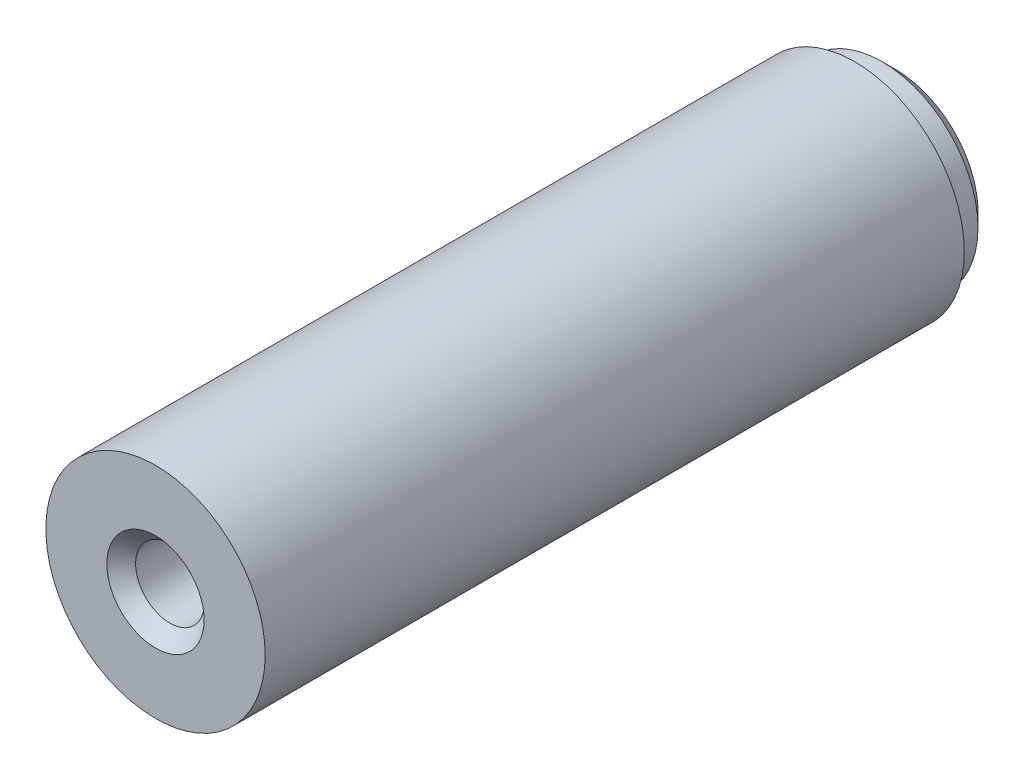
ISO-10303-21;
HEADER;
FILE_DESCRIPTION(('STEP AP214'),'2;1');
FILE_NAME('part.step','',(''),(''),'','','');
FILE_SCHEMA(('AUTOMOTIVE_DESIGN { 1 0 10303 214 1 1 1 1 }'));
ENDSEC;
DATA;
#1=APPLICATION_CONTEXT('core data for automotive mechanical design processes');
#2=APPLICATION_PROTOCOL_DEFINITION('international standard','automotive_design',2000,#1);
#3=PRODUCT_CONTEXT('',#1,'mechanical');
#4=PRODUCT('Part','Part','',(#3));
#5=PRODUCT_RELATED_PRODUCT_CATEGORY('part','',(#4));
#6=PRODUCT_DEFINITION_FORMATION('','',#4);
#7=PRODUCT_DEFINITION_CONTEXT('part definition',#1,'design');
#8=PRODUCT_DEFINITION('design','',#6,#7);
#9=PRODUCT_DEFINITION_SHAPE('','',#8);
#10=(LENGTH_UNIT() NAMED_UNIT(*) SI_UNIT(.MILLI.,.METRE.));
#11=(NAMED_UNIT(*) PLANE_ANGLE_UNIT() SI_UNIT($,.RADIAN.));
#12=(NAMED_UNIT(*) SI_UNIT($,.STERADIAN.) SOLID_ANGLE_UNIT());
#13=UNCERTAINTY_MEASURE_WITH_UNIT(LENGTH_MEASURE(1.E-05),#10,'distance_accuracy_value','');
#14=(GEOMETRIC_REPRESENTATION_CONTEXT(3) GLOBAL_UNCERTAINTY_ASSIGNED_CONTEXT((#13)) GLOBAL_UNIT_ASSIGNED_CONTEXT((#10,
#11,#12)) REPRESENTATION_CONTEXT('',''));
#15=CARTESIAN_POINT('',(0.,0.,0.));
#16=DIRECTION('',(0.,0.,1.));
#17=DIRECTION('',(1.,0.,0.));
#18=AXIS2_PLACEMENT_3D('',#15,#16,#17);
#19=CARTESIAN_POINT('',(0.,0.,0.));
#20=DIRECTION('',(0.,0.,1.));
#21=DIRECTION('',(1.,0.,0.));
#22=AXIS2_PLACEMENT_3D('',#19,#20,#21);
#23=PLANE('',#22);
#24=CARTESIAN_POINT('',(0.,0.,0.));
#25=DIRECTION('',(0.,0.,1.));
#26=DIRECTION('',(1.,0.,0.));
#27=AXIS2_PLACEMENT_3D('',#24,#25,#26);
#28=CIRCLE('',#27,4.);
#29=CARTESIAN_POINT('',(4.,0.,0.));
#30=VERTEX_POINT('',#29);
#31=EDGE_CURVE('E73',#30,#30,#28,.T.);
#32=ORIENTED_EDGE('',*,*,#31,.F.);
#33=EDGE_LOOP('',(#32));
#34=FACE_BOUND('',#33,.T.);
#35=CARTESIAN_POINT('',(0.,0.,0.));
#36=DIRECTION('',(0.,0.,1.));
#37=DIRECTION('',(1.,0.,0.));
#38=AXIS2_PLACEMENT_3D('',#35,#36,#37);
#39=CIRCLE('',#38,3.5);
#40=CARTESIAN_POINT('',(3.5,0.,0.));
#41=VERTEX_POINT('',#40);
#42=EDGE_CURVE('E85',#41,#41,#39,.F.);
#43=ORIENTED_EDGE('',*,*,#42,.F.);
#44=EDGE_LOOP('',(#43));
#45=FACE_BOUND('',#44,.T.);
#46=ADVANCED_FACE('F53',(#34,#45),#23,.F.);
#47=CARTESIAN_POINT('',(0.,0.,25.5));
#48=DIRECTION('',(0.,0.,-1.));
#49=DIRECTION('',(-1.,0.,0.));
#50=AXIS2_PLACEMENT_3D('',#47,#48,#49);
#51=CYLINDRICAL_SURFACE('',#50,4.);
#52=CARTESIAN_POINT('',(0.,0.,25.5));
#53=DIRECTION('',(0.,0.,1.));
#54=DIRECTION('',(1.,0.,0.));
#55=AXIS2_PLACEMENT_3D('',#52,#53,#54);
#56=CIRCLE('',#55,4.);
#57=CARTESIAN_POINT('',(4.,0.,25.5));
#58=VERTEX_POINT('',#57);
#59=EDGE_CURVE('E77',#58,#58,#56,.T.);
#60=ORIENTED_EDGE('',*,*,#59,.F.);
#61=EDGE_LOOP('',(#60));
#62=FACE_BOUND('',#61,.T.);
#63=ORIENTED_EDGE('',*,*,#31,.T.);
#64=EDGE_LOOP('',(#63));
#65=FACE_BOUND('',#64,.T.);
#66=ADVANCED_FACE('F102',(#62,#65),#51,.T.);
#67=CARTESIAN_POINT('',(0.,0.,25.5));
#68=DIRECTION('',(0.,0.,1.));
#69=DIRECTION('',(1.,0.,0.));
#70=AXIS2_PLACEMENT_3D('',#67,#68,#69);
#71=PLANE('',#70);
#72=CARTESIAN_POINT('',(0.,0.,25.5));
#73=DIRECTION('',(0.,0.,1.));
#74=DIRECTION('',(1.,0.,0.));
#75=AXIS2_PLACEMENT_3D('',#72,#73,#74);
#76=CIRCLE('',#75,1.775);
#77=CARTESIAN_POINT('',(1.775,0.,25.5));
#78=VERTEX_POINT('',#77);
#79=EDGE_CURVE('E80',#78,#78,#76,.T.);
#80=ORIENTED_EDGE('',*,*,#79,.F.);
#81=EDGE_LOOP('',(#80));
#82=FACE_BOUND('',#81,.T.);
#83=ORIENTED_EDGE('',*,*,#59,.T.);
#84=EDGE_LOOP('',(#83));
#85=FACE_BOUND('',#84,.T.);
#86=ADVANCED_FACE('F67',(#82,#85),#71,.T.);
#87=CARTESIAN_POINT('',(0.,0.,10.5));
#88=DIRECTION('',(0.,0.,1.));
#89=DIRECTION('',(1.,0.,0.));
#90=AXIS2_PLACEMENT_3D('',#87,#88,#89);
#91=CONICAL_SURFACE('',#90,1.25,1.02974425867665);
#92=CARTESIAN_POINT('',(0.,0.,9.74892422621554));
#93=VERTEX_POINT('',#92);
#94=VERTEX_LOOP('',#93);
#95=FACE_BOUND('',#94,.T.);
#96=CARTESIAN_POINT('',(0.,0.,10.5));
#97=DIRECTION('',(0.,0.,1.));
#98=DIRECTION('',(1.,0.,0.));
#99=AXIS2_PLACEMENT_3D('',#96,#97,#98);
#100=CIRCLE('',#99,1.25);
#101=CARTESIAN_POINT('',(1.25,0.,10.5));
#102=VERTEX_POINT('',#101);
#103=EDGE_CURVE('E71',#102,#102,#100,.T.);
#104=ORIENTED_EDGE('',*,*,#103,.T.);
#105=EDGE_LOOP('',(#104));
#106=FACE_BOUND('',#105,.T.);
#107=ADVANCED_FACE('F63',(#95,#106),#91,.F.);
#108=CARTESIAN_POINT('',(0.,0.,25.5));
#109=DIRECTION('',(0.,0.,1.));
#110=DIRECTION('',(1.,0.,0.));
#111=AXIS2_PLACEMENT_3D('',#108,#109,#110);
#112=CYLINDRICAL_SURFACE('',#111,1.25);
#113=ORIENTED_EDGE('',*,*,#103,.F.);
#114=EDGE_LOOP('',(#113));
#115=FACE_BOUND('',#114,.T.);
#116=CARTESIAN_POINT('',(0.,0.,24.975));
#117=DIRECTION('',(0.,0.,1.));
#118=DIRECTION('',(1.,0.,0.));
#119=AXIS2_PLACEMENT_3D('',#116,#117,#118);
#120=CIRCLE('',#119,1.25);
#121=CARTESIAN_POINT('',(1.25,0.,24.975));
#122=VERTEX_POINT('',#121);
#123=EDGE_CURVE('E74',#122,#122,#120,.T.);
#124=ORIENTED_EDGE('',*,*,#123,.T.);
#125=EDGE_LOOP('',(#124));
#126=FACE_BOUND('',#125,.T.);
#127=ADVANCED_FACE('F66',(#115,#126),#112,.F.);
#128=CARTESIAN_POINT('',(0.,0.,25.5));
#129=DIRECTION('',(0.,0.,1.));
#130=DIRECTION('',(1.,0.,0.));
#131=AXIS2_PLACEMENT_3D('',#128,#129,#130);
#132=CONICAL_SURFACE('',#131,1.775,0.785398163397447);
#133=ORIENTED_EDGE('',*,*,#123,.F.);
#134=EDGE_LOOP('',(#133));
#135=FACE_BOUND('',#134,.T.);
#136=ORIENTED_EDGE('',*,*,#79,.T.);
#137=EDGE_LOOP('',(#136));
#138=FACE_BOUND('',#137,.T.);
#139=ADVANCED_FACE('F119',(#135,#138),#132,.F.);
#140=CARTESIAN_POINT('',(0.,0.,-1.5));
#141=DIRECTION('',(0.,0.,1.));
#142=DIRECTION('',(1.,0.,0.));
#143=AXIS2_PLACEMENT_3D('',#140,#141,#142);
#144=CYLINDRICAL_SURFACE('',#143,3.5);
#145=CARTESIAN_POINT('',(0.,0.,-1.));
#146=DIRECTION('',(0.,0.,-1.));
#147=DIRECTION('',(-1.,0.,0.));
#148=AXIS2_PLACEMENT_3D('',#145,#146,#147);
#149=CIRCLE('',#148,3.5);
#150=CARTESIAN_POINT('',(-3.5,0.,-1.));
#151=VERTEX_POINT('',#150);
#152=EDGE_CURVE('E13',#151,#151,#149,.F.);
#153=ORIENTED_EDGE('',*,*,#152,.T.);
#154=EDGE_LOOP('',(#153));
#155=FACE_BOUND('',#154,.T.);
#156=ORIENTED_EDGE('',*,*,#42,.T.);
#157=EDGE_LOOP('',(#156));
#158=FACE_BOUND('',#157,.T.);
#159=ADVANCED_FACE('F98',(#155,#158),#144,.T.);
#160=CARTESIAN_POINT('',(0.,0.,-1.5));
#161=DIRECTION('',(0.,0.,-1.));
#162=DIRECTION('',(-1.,0.,0.));
#163=AXIS2_PLACEMENT_3D('',#160,#161,#162);
#164=PLANE('',#163);
#165=CARTESIAN_POINT('',(0.,0.,-1.5));
#166=DIRECTION('',(0.,0.,-1.));
#167=DIRECTION('',(-1.,0.,0.));
#168=AXIS2_PLACEMENT_3D('',#165,#166,#167);
#169=CIRCLE('',#168,3.);
#170=CARTESIAN_POINT('',(-3.,0.,-1.5));
#171=VERTEX_POINT('',#170);
#172=EDGE_CURVE('E60',#171,#171,#169,.T.);
#173=ORIENTED_EDGE('',*,*,#172,.T.);
#174=EDGE_LOOP('',(#173));
#175=FACE_BOUND('',#174,.T.);
#176=ADVANCED_FACE('F91',(#175),#164,.T.);
#177=CARTESIAN_POINT('',(0.,0.,-1.5));
#178=DIRECTION('',(0.,0.,1.));
#179=DIRECTION('',(1.,0.,0.));
#180=AXIS2_PLACEMENT_3D('',#177,#178,#179);
#181=CONICAL_SURFACE('',#180,3.,0.785398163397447);
#182=ORIENTED_EDGE('',*,*,#152,.F.);
#183=EDGE_LOOP('',(#182));
#184=FACE_BOUND('',#183,.T.);
#185=ORIENTED_EDGE('',*,*,#172,.F.);
#186=EDGE_LOOP('',(#185));
#187=FACE_BOUND('',#186,.T.);
#188=ADVANCED_FACE('F55',(#184,#187),#181,.T.);
#189=CLOSED_SHELL('',(#46,#66,#86,#107,#127,#139,#159,#176,#188));
#190=MANIFOLD_SOLID_BREP('B2',#189);
#191=ADVANCED_BREP_SHAPE_REPRESENTATION('',(#18,#190),#14);
#192=SHAPE_DEFINITION_REPRESENTATION(#9,#191);
ENDSEC;
END-ISO-10303-21;
